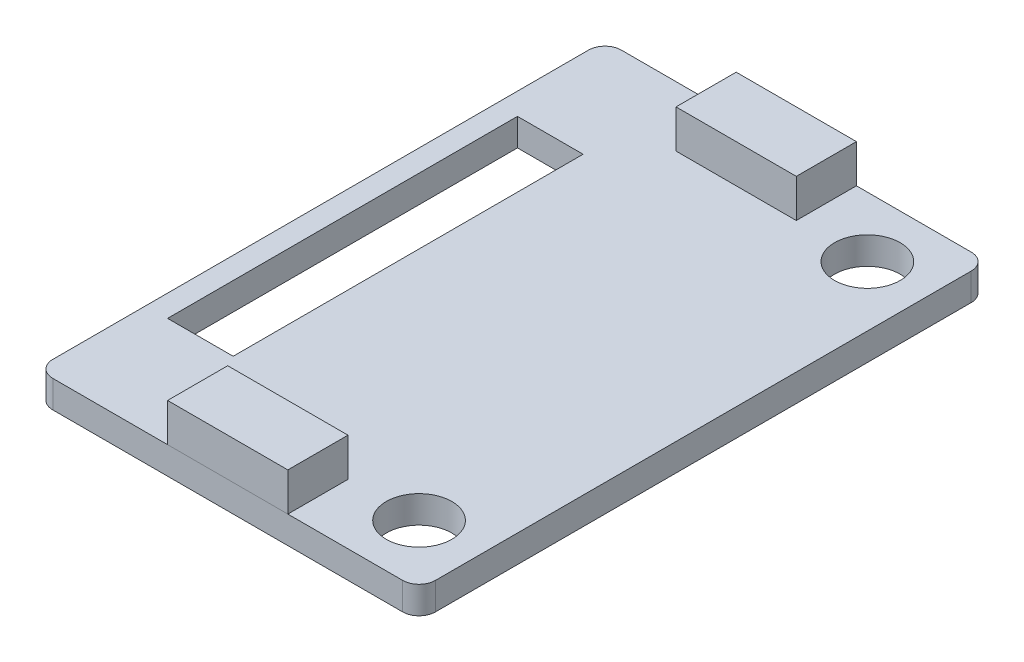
from build123d import *

# Parameters (mm, degrees)
SKETCH1_W             = 17.5
SKETCH1_H             = 26
SKETCH1_R             = 1.5
SKETCH1_W_2           = 3
SKETCH1_H_2           = 16
BOSS_EXTRUDE1_DEPTH   = 1.25
FILLET1_R             = 0.75
SKETCH2_W             = 5.5
SKETCH2_H             = 2.75
BOSS_EXTRUDE2_DEPTH   = 1.75
BOSS_EXTRUDE2_2_DEPTH = 1.75


with BuildPart() as part:
    # Sketch1 → Boss-Extrude1 (new body)
    with BuildSketch(Plane(origin=(0, 0, 0), x_dir=(1, 0, 0), z_dir=(0, 1, 0))):
        Rectangle(SKETCH1_W, SKETCH1_H)
        with Locations(Location((6, 10.25, 0), (0, 0, 270))):
            Circle(SKETCH1_R, mode=Mode.SUBTRACT)
        with Locations(Location((6, -10.25, 0), (0, 0, 90))):
            Circle(SKETCH1_R, mode=Mode.SUBTRACT)
        with Locations((-6.25, 0)):
            Rectangle(SKETCH1_W_2, SKETCH1_H_2, mode=Mode.SUBTRACT)
    extrude(amount=BOSS_EXTRUDE1_DEPTH)

    # Fillet1
    fillet1_edges = [part.edges().sort_by_distance(p)[0] for p in [
        (8.75, 0.625, 13),
        (-8.75, 0.625, 13),
        (-8.75, 0.625, -13),
        (8.75, 0.625, -13),
    ]]
    fillet(fillet1_edges, radius=FILLET1_R)


with BuildPart() as body_2:
    # Sketch2 → Boss-Extrude2 (new body)
    with BuildSketch(Plane(origin=(0, 1.25, 0), x_dir=(1, 0, 0), z_dir=(0, 1, 0))):
        with Locations((0, -11.625)):
            Rectangle(SKETCH2_W, SKETCH2_H)
    extrude(amount=BOSS_EXTRUDE2_DEPTH)


with BuildPart() as body_3:
    # Sketch2 → Boss-Extrude2 2 (new body)
    with BuildSketch(Plane(origin=(0, 1.25, 0), x_dir=(1, 0, 0), z_dir=(0, 1, 0))):
        with Locations((0, 11.625)):
            Rectangle(SKETCH2_W, SKETCH2_H)
    extrude(amount=BOSS_EXTRUDE2_2_DEPTH)


solid = Compound([part.part, body_2.part, body_3.part])
